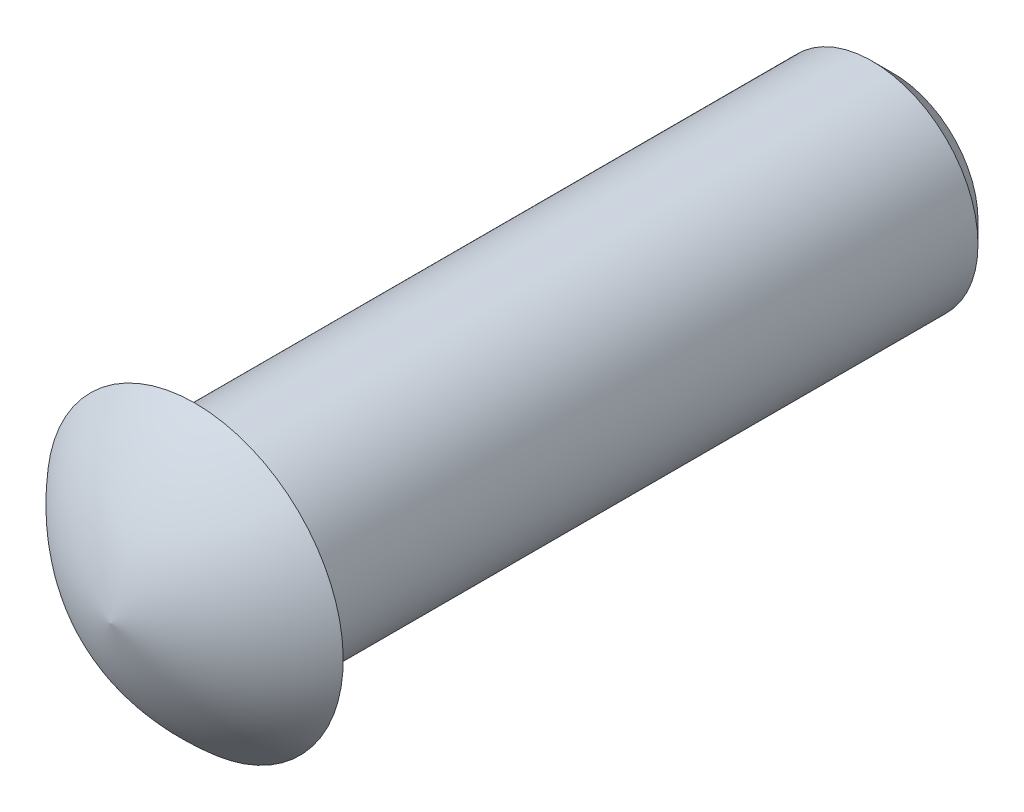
ISO-10303-21;
HEADER;
FILE_DESCRIPTION(('STEP AP214'),'2;1');
FILE_NAME('part.step','',(''),(''),'','','');
FILE_SCHEMA(('AUTOMOTIVE_DESIGN { 1 0 10303 214 1 1 1 1 }'));
ENDSEC;
DATA;
#1=APPLICATION_CONTEXT('core data for automotive mechanical design processes');
#2=APPLICATION_PROTOCOL_DEFINITION('international standard','automotive_design',2000,#1);
#3=PRODUCT_CONTEXT('',#1,'mechanical');
#4=PRODUCT('Part','Part','',(#3));
#5=PRODUCT_RELATED_PRODUCT_CATEGORY('part','',(#4));
#6=PRODUCT_DEFINITION_FORMATION('','',#4);
#7=PRODUCT_DEFINITION_CONTEXT('part definition',#1,'design');
#8=PRODUCT_DEFINITION('design','',#6,#7);
#9=PRODUCT_DEFINITION_SHAPE('','',#8);
#10=(LENGTH_UNIT() NAMED_UNIT(*) SI_UNIT(.MILLI.,.METRE.));
#11=(NAMED_UNIT(*) PLANE_ANGLE_UNIT() SI_UNIT($,.RADIAN.));
#12=(NAMED_UNIT(*) SI_UNIT($,.STERADIAN.) SOLID_ANGLE_UNIT());
#13=UNCERTAINTY_MEASURE_WITH_UNIT(LENGTH_MEASURE(1.E-05),#10,'distance_accuracy_value','');
#14=(GEOMETRIC_REPRESENTATION_CONTEXT(3) GLOBAL_UNCERTAINTY_ASSIGNED_CONTEXT((#13)) GLOBAL_UNIT_ASSIGNED_CONTEXT((#10,
#11,#12)) REPRESENTATION_CONTEXT('',''));
#15=CARTESIAN_POINT('',(0.,0.,0.));
#16=DIRECTION('',(0.,0.,1.));
#17=DIRECTION('',(1.,0.,0.));
#18=AXIS2_PLACEMENT_3D('',#15,#16,#17);
#19=CARTESIAN_POINT('',(0.,0.,33.));
#20=DIRECTION('',(0.,0.,-1.));
#21=DIRECTION('',(-1.,0.,0.));
#22=AXIS2_PLACEMENT_3D('',#19,#20,#21);
#23=CYLINDRICAL_SURFACE('',#22,5.);
#24=CARTESIAN_POINT('',(0.,0.,1.));
#25=DIRECTION('',(0.,0.,1.));
#26=DIRECTION('',(1.,0.,0.));
#27=AXIS2_PLACEMENT_3D('',#24,#25,#26);
#28=CIRCLE('',#27,5.);
#29=CARTESIAN_POINT('',(5.,0.,1.));
#30=VERTEX_POINT('',#29);
#31=EDGE_CURVE('E41',#30,#30,#28,.T.);
#32=ORIENTED_EDGE('',*,*,#31,.T.);
#33=EDGE_LOOP('',(#32));
#34=FACE_BOUND('',#33,.T.);
#35=CARTESIAN_POINT('',(0.,0.,33.));
#36=DIRECTION('',(0.,0.,1.));
#37=DIRECTION('',(1.,0.,0.));
#38=AXIS2_PLACEMENT_3D('',#35,#36,#37);
#39=CIRCLE('',#38,5.);
#40=CARTESIAN_POINT('',(5.,0.,33.));
#41=VERTEX_POINT('',#40);
#42=EDGE_CURVE('E53',#41,#41,#39,.T.);
#43=ORIENTED_EDGE('',*,*,#42,.F.);
#44=EDGE_LOOP('',(#43));
#45=FACE_BOUND('',#44,.T.);
#46=ADVANCED_FACE('F34',(#34,#45),#23,.T.);
#47=CARTESIAN_POINT('',(0.,0.,0.));
#48=DIRECTION('',(0.,0.,1.));
#49=DIRECTION('',(1.,0.,0.));
#50=AXIS2_PLACEMENT_3D('',#47,#48,#49);
#51=PLANE('',#50);
#52=CARTESIAN_POINT('',(0.,0.,0.));
#53=DIRECTION('',(0.,0.,1.));
#54=DIRECTION('',(1.,0.,0.));
#55=AXIS2_PLACEMENT_3D('',#52,#53,#54);
#56=CIRCLE('',#55,4.);
#57=CARTESIAN_POINT('',(4.,0.,0.));
#58=VERTEX_POINT('',#57);
#59=EDGE_CURVE('E11',#58,#58,#56,.F.);
#60=ORIENTED_EDGE('',*,*,#59,.T.);
#61=EDGE_LOOP('',(#60));
#62=FACE_BOUND('',#61,.T.);
#63=ADVANCED_FACE('F68',(#62),#51,.F.);
#64=CARTESIAN_POINT('',(0.,0.,33.));
#65=DIRECTION('',(0.,0.,-1.));
#66=DIRECTION('',(0.,1.,0.));
#67=AXIS2_PLACEMENT_3D('',#64,#65,#66);
#68=PLANE('',#67);
#69=ORIENTED_EDGE('',*,*,#42,.T.);
#70=EDGE_LOOP('',(#69));
#71=FACE_BOUND('',#70,.T.);
#72=CARTESIAN_POINT('',(0.,0.,33.));
#73=DIRECTION('',(0.,0.,-1.));
#74=DIRECTION('',(0.,1.,0.));
#75=AXIS2_PLACEMENT_3D('',#72,#73,#74);
#76=CIRCLE('',#75,7.);
#77=CARTESIAN_POINT('',(0.,7.,33.));
#78=VERTEX_POINT('',#77);
#79=EDGE_CURVE('E51',#78,#78,#76,.T.);
#80=ORIENTED_EDGE('',*,*,#79,.T.);
#81=EDGE_LOOP('',(#80));
#82=FACE_BOUND('',#81,.T.);
#83=ADVANCED_FACE('F47',(#71,#82),#68,.T.);
#84=CARTESIAN_POINT('',(0.,-2.10768703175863,25.1865476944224));
#85=DIRECTION('',(-1.,0.,0.));
#86=DIRECTION('',(0.,1.,0.));
#87=AXIS2_PLACEMENT_3D('',#84,#85,#86);
#88=CIRCLE('',#87,12.);
#89=TRIMMED_CURVE('',#88,(PARAMETER_VALUE(-1.39423989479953)),
(PARAMETER_VALUE(1.39423989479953)),.T.,.PARAMETER.);
#90=CARTESIAN_POINT('',(0.,0.,25.1865476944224));
#91=DIRECTION('',(0.,0.,-1.));
#92=AXIS1_PLACEMENT('',#90,#91);
#93=SURFACE_OF_REVOLUTION('',#89,#92);
#94=CARTESIAN_POINT('',(0.,0.,37.));
#95=VERTEX_POINT('',#94);
#96=VERTEX_LOOP('',#95);
#97=FACE_BOUND('',#96,.T.);
#98=ORIENTED_EDGE('',*,*,#79,.F.);
#99=EDGE_LOOP('',(#98));
#100=FACE_BOUND('',#99,.T.);
#101=ADVANCED_FACE('F44',(#97,#100),#93,.T.);
#102=CARTESIAN_POINT('',(0.,0.,1.));
#103=DIRECTION('',(0.,0.,1.));
#104=DIRECTION('',(1.,0.,0.));
#105=AXIS2_PLACEMENT_3D('',#102,#103,#104);
#106=CONICAL_SURFACE('',#105,5.,0.78539816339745);
#107=ORIENTED_EDGE('',*,*,#59,.F.);
#108=EDGE_LOOP('',(#107));
#109=FACE_BOUND('',#108,.T.);
#110=ORIENTED_EDGE('',*,*,#31,.F.);
#111=EDGE_LOOP('',(#110));
#112=FACE_BOUND('',#111,.T.);
#113=ADVANCED_FACE('F36',(#109,#112),#106,.T.);
#114=CLOSED_SHELL('',(#46,#63,#83,#101,#113));
#115=MANIFOLD_SOLID_BREP('B2',#114);
#116=ADVANCED_BREP_SHAPE_REPRESENTATION('',(#18,#115),#14);
#117=SHAPE_DEFINITION_REPRESENTATION(#9,#116);
ENDSEC;
END-ISO-10303-21;
